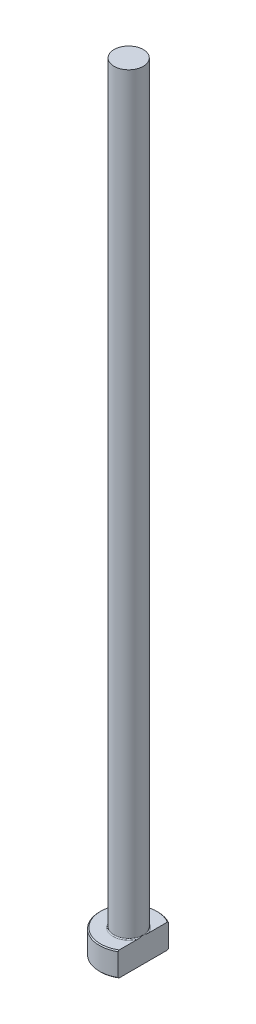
from build123d import *
from build123d.topology import SkipClean

# Parameters (mm, degrees)
CHAMFER1_SIZE = 0.2
FILLET1_R     = 0.2
KEY_DEPTH     = 161.224842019


with BuildPart() as part:
    # Sketch1 → Revolve1 (revolve)
    with BuildSketch(Plane.XY, mode=Mode.PRIVATE) as revolve1_sk:
        Polygon((0, 0), (-6, 0), (-6, 5), (-3, 5), (-3, 160), (0, 160), align=None)
    revolve(revolve1_sk.sketch.rotate(Axis((0, 259.958771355, 0), (0, -1, 0)), 270), axis=Axis((0, 259.958771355, 0), (0, -1, 0)))

    # Chamfer1
    chamfer1_edges = [part.edges().sort_by_distance(p)[0] for p in [
        (0, 5, -6),
        (0, 0, -6),
    ]]
    chamfer(chamfer1_edges, length=CHAMFER1_SIZE)

    # Fillet1
    fillet1_edges = [part.edges().sort_by_distance(p)[0] for p in [
        (0, 5, -3),
    ]]
    fillet(fillet1_edges, radius=FILLET1_R)

    # Sketch2 → KEY (cut, through all)
    with SkipClean():  # the faces are left unmerged after this step: merging them gives an invalid solid
        with BuildSketch(Plane(origin=(0, 0, 0), x_dir=(1, 0, 0), z_dir=(0, 1, 0))):
            with BuildLine():
                Line((3, 5.196152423), (3, -5.196152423))
                ThreePointArc((3, -5.196152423), (6, 0), (3, 5.196152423))
            make_face()
        extrude(amount=KEY_DEPTH, mode=Mode.SUBTRACT)


solid = part.part
